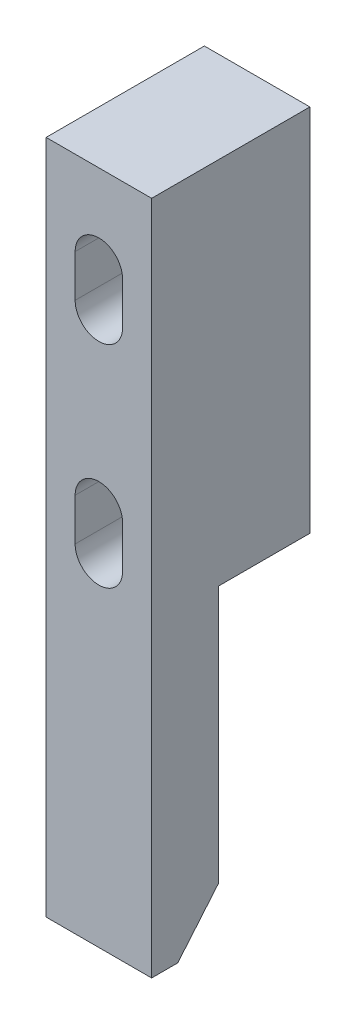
ISO-10303-21;
HEADER;
FILE_DESCRIPTION(('STEP AP214'),'2;1');
FILE_NAME('part.step','',(''),(''),'','','');
FILE_SCHEMA(('AUTOMOTIVE_DESIGN { 1 0 10303 214 1 1 1 1 }'));
ENDSEC;
DATA;
#1=APPLICATION_CONTEXT('core data for automotive mechanical design processes');
#2=APPLICATION_PROTOCOL_DEFINITION('international standard','automotive_design',2000,#1);
#3=PRODUCT_CONTEXT('',#1,'mechanical');
#4=PRODUCT('Part','Part','',(#3));
#5=PRODUCT_RELATED_PRODUCT_CATEGORY('part','',(#4));
#6=PRODUCT_DEFINITION_FORMATION('','',#4);
#7=PRODUCT_DEFINITION_CONTEXT('part definition',#1,'design');
#8=PRODUCT_DEFINITION('design','',#6,#7);
#9=PRODUCT_DEFINITION_SHAPE('','',#8);
#10=(LENGTH_UNIT() NAMED_UNIT(*) SI_UNIT(.MILLI.,.METRE.));
#11=(NAMED_UNIT(*) PLANE_ANGLE_UNIT() SI_UNIT($,.RADIAN.));
#12=(NAMED_UNIT(*) SI_UNIT($,.STERADIAN.) SOLID_ANGLE_UNIT());
#13=UNCERTAINTY_MEASURE_WITH_UNIT(LENGTH_MEASURE(1.E-05),#10,'distance_accuracy_value','');
#14=(GEOMETRIC_REPRESENTATION_CONTEXT(3) GLOBAL_UNCERTAINTY_ASSIGNED_CONTEXT((#13)) GLOBAL_UNIT_ASSIGNED_CONTEXT((#10,
#11,#12)) REPRESENTATION_CONTEXT('',''));
#15=CARTESIAN_POINT('',(0.,0.,0.));
#16=DIRECTION('',(0.,0.,1.));
#17=DIRECTION('',(1.,0.,0.));
#18=AXIS2_PLACEMENT_3D('',#15,#16,#17);
#19=CARTESIAN_POINT('',(10.,0.,0.));
#20=DIRECTION('',(0.,0.,1.));
#21=DIRECTION('',(1.,0.,0.));
#22=AXIS2_PLACEMENT_3D('',#19,#20,#21);
#23=PLANE('',#22);
#24=CARTESIAN_POINT('',(5.,52.,0.));
#25=DIRECTION('',(0.,0.,1.));
#26=DIRECTION('',(1.,0.,0.));
#27=AXIS2_PLACEMENT_3D('',#24,#25,#26);
#28=CIRCLE('',#27,2.25);
#29=CARTESIAN_POINT('',(2.75,52.,0.));
#30=VERTEX_POINT('',#29);
#31=CARTESIAN_POINT('',(7.25,52.,0.));
#32=VERTEX_POINT('',#31);
#33=EDGE_CURVE('E165',#30,#32,#28,.T.);
#34=ORIENTED_EDGE('',*,*,#33,.T.);
#35=DIRECTION('',(0.,1.,0.));
#36=VECTOR('',#35,1.);
#37=CARTESIAN_POINT('',(7.25,52.,0.));
#38=LINE('',#37,#36);
#39=CARTESIAN_POINT('',(7.25,56.,0.));
#40=VERTEX_POINT('',#39);
#41=EDGE_CURVE('E180',#32,#40,#38,.T.);
#42=ORIENTED_EDGE('',*,*,#41,.T.);
#43=CARTESIAN_POINT('',(5.,56.,0.));
#44=DIRECTION('',(0.,0.,1.));
#45=DIRECTION('',(1.,0.,0.));
#46=AXIS2_PLACEMENT_3D('',#43,#44,#45);
#47=CIRCLE('',#46,2.25);
#48=CARTESIAN_POINT('',(2.75,56.,0.));
#49=VERTEX_POINT('',#48);
#50=EDGE_CURVE('E183',#40,#49,#47,.T.);
#51=ORIENTED_EDGE('',*,*,#50,.T.);
#52=DIRECTION('',(0.,-1.,0.));
#53=VECTOR('',#52,1.);
#54=CARTESIAN_POINT('',(2.75,56.,0.));
#55=LINE('',#54,#53);
#56=EDGE_CURVE('E171',#49,#30,#55,.T.);
#57=ORIENTED_EDGE('',*,*,#56,.T.);
#58=EDGE_LOOP('',(#34,#42,#51,#57));
#59=FACE_BOUND('',#58,.T.);
#60=CARTESIAN_POINT('',(5.,32.,0.));
#61=DIRECTION('',(0.,0.,1.));
#62=DIRECTION('',(1.,0.,0.));
#63=AXIS2_PLACEMENT_3D('',#60,#61,#62);
#64=CIRCLE('',#63,2.25);
#65=CARTESIAN_POINT('',(2.75,32.,0.));
#66=VERTEX_POINT('',#65);
#67=CARTESIAN_POINT('',(7.25,32.,0.));
#68=VERTEX_POINT('',#67);
#69=EDGE_CURVE('E196',#66,#68,#64,.T.);
#70=ORIENTED_EDGE('',*,*,#69,.T.);
#71=DIRECTION('',(0.,1.,0.));
#72=VECTOR('',#71,1.);
#73=CARTESIAN_POINT('',(7.25,32.,0.));
#74=LINE('',#73,#72);
#75=CARTESIAN_POINT('',(7.25,36.,0.));
#76=VERTEX_POINT('',#75);
#77=EDGE_CURVE('E210',#68,#76,#74,.T.);
#78=ORIENTED_EDGE('',*,*,#77,.T.);
#79=CARTESIAN_POINT('',(5.,36.,0.));
#80=DIRECTION('',(0.,0.,1.));
#81=DIRECTION('',(1.,0.,0.));
#82=AXIS2_PLACEMENT_3D('',#79,#80,#81);
#83=CIRCLE('',#82,2.25);
#84=CARTESIAN_POINT('',(2.75,36.,0.));
#85=VERTEX_POINT('',#84);
#86=EDGE_CURVE('E213',#76,#85,#83,.T.);
#87=ORIENTED_EDGE('',*,*,#86,.T.);
#88=DIRECTION('',(0.,-1.,0.));
#89=VECTOR('',#88,1.);
#90=CARTESIAN_POINT('',(2.75,36.,0.));
#91=LINE('',#90,#89);
#92=EDGE_CURVE('E200',#85,#66,#91,.T.);
#93=ORIENTED_EDGE('',*,*,#92,.T.);
#94=EDGE_LOOP('',(#70,#78,#87,#93));
#95=FACE_BOUND('',#94,.T.);
#96=DIRECTION('',(1.,0.,0.));
#97=VECTOR('',#96,1.);
#98=CARTESIAN_POINT('',(-5.,29.,0.));
#99=LINE('',#98,#97);
#100=CARTESIAN_POINT('',(0.,29.,0.));
#101=VERTEX_POINT('',#100);
#102=CARTESIAN_POINT('',(10.,29.,0.));
#103=VERTEX_POINT('',#102);
#104=EDGE_CURVE('E147',#101,#103,#99,.T.);
#105=ORIENTED_EDGE('',*,*,#104,.F.);
#106=DIRECTION('',(0.,-1.,0.));
#107=VECTOR('',#106,1.);
#108=CARTESIAN_POINT('',(0.,0.,0.));
#109=LINE('',#108,#107);
#110=CARTESIAN_POINT('',(0.,64.,0.));
#111=VERTEX_POINT('',#110);
#112=EDGE_CURVE('E232',#111,#101,#109,.T.);
#113=ORIENTED_EDGE('',*,*,#112,.F.);
#114=DIRECTION('',(-1.,0.,0.));
#115=VECTOR('',#114,1.);
#116=CARTESIAN_POINT('',(0.,64.,0.));
#117=LINE('',#116,#115);
#118=CARTESIAN_POINT('',(10.,64.,0.));
#119=VERTEX_POINT('',#118);
#120=EDGE_CURVE('E240',#119,#111,#117,.T.);
#121=ORIENTED_EDGE('',*,*,#120,.F.);
#122=DIRECTION('',(0.,1.,0.));
#123=VECTOR('',#122,1.);
#124=CARTESIAN_POINT('',(10.,0.,0.));
#125=LINE('',#124,#123);
#126=EDGE_CURVE('E227',#103,#119,#125,.T.);
#127=ORIENTED_EDGE('',*,*,#126,.F.);
#128=EDGE_LOOP('',(#105,#113,#121,#127));
#129=FACE_BOUND('',#128,.T.);
#130=ADVANCED_FACE('F33',(#59,#95,#129),#23,.F.);
#131=CARTESIAN_POINT('',(0.,0.,15.));
#132=DIRECTION('',(0.,1.,0.));
#133=DIRECTION('',(0.,0.,1.));
#134=AXIS2_PLACEMENT_3D('',#131,#132,#133);
#135=PLANE('',#134);
#136=DIRECTION('',(1.,0.,0.));
#137=VECTOR('',#136,1.);
#138=CARTESIAN_POINT('',(-5.,0.,12.5236974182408));
#139=LINE('',#138,#137);
#140=CARTESIAN_POINT('',(0.,0.,12.5236974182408));
#141=VERTEX_POINT('',#140);
#142=CARTESIAN_POINT('',(10.,0.,12.5236974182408));
#143=VERTEX_POINT('',#142);
#144=EDGE_CURVE('E162',#141,#143,#139,.T.);
#145=ORIENTED_EDGE('',*,*,#144,.T.);
#146=DIRECTION('',(0.,0.,-1.));
#147=VECTOR('',#146,1.);
#148=CARTESIAN_POINT('',(10.,0.,15.));
#149=LINE('',#148,#147);
#150=CARTESIAN_POINT('',(10.,0.,15.));
#151=VERTEX_POINT('',#150);
#152=EDGE_CURVE('E252',#151,#143,#149,.T.);
#153=ORIENTED_EDGE('',*,*,#152,.F.);
#154=DIRECTION('',(1.,0.,0.));
#155=VECTOR('',#154,1.);
#156=CARTESIAN_POINT('',(0.,0.,15.));
#157=LINE('',#156,#155);
#158=CARTESIAN_POINT('',(0.,0.,15.));
#159=VERTEX_POINT('',#158);
#160=EDGE_CURVE('E228',#159,#151,#157,.T.);
#161=ORIENTED_EDGE('',*,*,#160,.F.);
#162=DIRECTION('',(0.,0.,-1.));
#163=VECTOR('',#162,1.);
#164=CARTESIAN_POINT('',(0.,0.,15.));
#165=LINE('',#164,#163);
#166=EDGE_CURVE('E238',#159,#141,#165,.T.);
#167=ORIENTED_EDGE('',*,*,#166,.T.);
#168=EDGE_LOOP('',(#145,#153,#161,#167));
#169=FACE_BOUND('',#168,.T.);
#170=ADVANCED_FACE('F35',(#169),#135,.F.);
#171=CARTESIAN_POINT('',(10.,0.,15.));
#172=DIRECTION('',(-1.,0.,0.));
#173=DIRECTION('',(0.,0.,1.));
#174=AXIS2_PLACEMENT_3D('',#171,#172,#173);
#175=PLANE('',#174);
#176=DIRECTION('',(0.,0.766044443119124,-0.642787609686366));
#177=VECTOR('',#176,1.);
#178=CARTESIAN_POINT('',(10.,0.,12.5236974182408));
#179=LINE('',#178,#177);
#180=CARTESIAN_POINT('',(10.,4.61649281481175,8.65000000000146));
#181=VERTEX_POINT('',#180);
#182=EDGE_CURVE('E158',#143,#181,#179,.T.);
#183=ORIENTED_EDGE('',*,*,#182,.T.);
#184=DIRECTION('',(0.,1.,0.));
#185=VECTOR('',#184,1.);
#186=CARTESIAN_POINT('',(10.,4.61649281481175,8.65000000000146));
#187=LINE('',#186,#185);
#188=CARTESIAN_POINT('',(10.,29.,8.65000000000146));
#189=VERTEX_POINT('',#188);
#190=EDGE_CURVE('E141',#181,#189,#187,.T.);
#191=ORIENTED_EDGE('',*,*,#190,.T.);
#192=DIRECTION('',(0.,0.,-1.));
#193=VECTOR('',#192,1.);
#194=CARTESIAN_POINT('',(10.,29.,8.65000000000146));
#195=LINE('',#194,#193);
#196=EDGE_CURVE('E150',#189,#103,#195,.T.);
#197=ORIENTED_EDGE('',*,*,#196,.T.);
#198=ORIENTED_EDGE('',*,*,#126,.T.);
#199=DIRECTION('',(0.,0.,-1.));
#200=VECTOR('',#199,1.);
#201=CARTESIAN_POINT('',(10.,64.,15.));
#202=LINE('',#201,#200);
#203=CARTESIAN_POINT('',(10.,64.,15.));
#204=VERTEX_POINT('',#203);
#205=EDGE_CURVE('E249',#204,#119,#202,.T.);
#206=ORIENTED_EDGE('',*,*,#205,.F.);
#207=DIRECTION('',(0.,1.,0.));
#208=VECTOR('',#207,1.);
#209=CARTESIAN_POINT('',(10.,0.,15.));
#210=LINE('',#209,#208);
#211=EDGE_CURVE('E231',#151,#204,#210,.T.);
#212=ORIENTED_EDGE('',*,*,#211,.F.);
#213=ORIENTED_EDGE('',*,*,#152,.T.);
#214=EDGE_LOOP('',(#183,#191,#197,#198,#206,#212,#213));
#215=FACE_BOUND('',#214,.T.);
#216=ADVANCED_FACE('F156',(#215),#175,.F.);
#217=CARTESIAN_POINT('',(0.,0.,15.));
#218=DIRECTION('',(1.,0.,0.));
#219=DIRECTION('',(0.,0.,-1.));
#220=AXIS2_PLACEMENT_3D('',#217,#218,#219);
#221=PLANE('',#220);
#222=DIRECTION('',(0.,0.766044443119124,-0.642787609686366));
#223=VECTOR('',#222,1.);
#224=CARTESIAN_POINT('',(0.,-1.21934099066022,13.5468459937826));
#225=LINE('',#224,#223);
#226=CARTESIAN_POINT('',(0.,4.61649281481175,8.65000000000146));
#227=VERTEX_POINT('',#226);
#228=EDGE_CURVE('E12',#141,#227,#225,.T.);
#229=ORIENTED_EDGE('',*,*,#228,.F.);
#230=ORIENTED_EDGE('',*,*,#166,.F.);
#231=DIRECTION('',(0.,-1.,0.));
#232=VECTOR('',#231,1.);
#233=CARTESIAN_POINT('',(0.,0.,15.));
#234=LINE('',#233,#232);
#235=CARTESIAN_POINT('',(0.,64.,15.));
#236=VERTEX_POINT('',#235);
#237=EDGE_CURVE('E236',#236,#159,#234,.T.);
#238=ORIENTED_EDGE('',*,*,#237,.F.);
#239=DIRECTION('',(0.,0.,-1.));
#240=VECTOR('',#239,1.);
#241=CARTESIAN_POINT('',(0.,64.,15.));
#242=LINE('',#241,#240);
#243=EDGE_CURVE('E246',#236,#111,#242,.T.);
#244=ORIENTED_EDGE('',*,*,#243,.T.);
#245=ORIENTED_EDGE('',*,*,#112,.T.);
#246=DIRECTION('',(0.,0.,-1.));
#247=VECTOR('',#246,1.);
#248=CARTESIAN_POINT('',(0.,29.,15.));
#249=LINE('',#248,#247);
#250=CARTESIAN_POINT('',(0.,29.,8.65000000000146));
#251=VERTEX_POINT('',#250);
#252=EDGE_CURVE('E41',#251,#101,#249,.T.);
#253=ORIENTED_EDGE('',*,*,#252,.F.);
#254=DIRECTION('',(0.,1.,0.));
#255=VECTOR('',#254,1.);
#256=CARTESIAN_POINT('',(0.,0.,8.65000000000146));
#257=LINE('',#256,#255);
#258=EDGE_CURVE('E144',#227,#251,#257,.T.);
#259=ORIENTED_EDGE('',*,*,#258,.F.);
#260=EDGE_LOOP('',(#229,#230,#238,#244,#245,#253,#259));
#261=FACE_BOUND('',#260,.T.);
#262=ADVANCED_FACE('F259',(#261),#221,.F.);
#263=CARTESIAN_POINT('',(10.,0.,15.));
#264=DIRECTION('',(0.,0.,1.));
#265=DIRECTION('',(1.,0.,0.));
#266=AXIS2_PLACEMENT_3D('',#263,#264,#265);
#267=PLANE('',#266);
#268=DIRECTION('',(0.,1.,0.));
#269=VECTOR('',#268,1.);
#270=CARTESIAN_POINT('',(7.25,32.,15.));
#271=LINE('',#270,#269);
#272=CARTESIAN_POINT('',(7.25,32.,15.));
#273=VERTEX_POINT('',#272);
#274=CARTESIAN_POINT('',(7.25,36.,15.));
#275=VERTEX_POINT('',#274);
#276=EDGE_CURVE('E199',#273,#275,#271,.T.);
#277=ORIENTED_EDGE('',*,*,#276,.F.);
#278=CARTESIAN_POINT('',(5.,32.,15.));
#279=DIRECTION('',(0.,0.,1.));
#280=DIRECTION('',(1.,0.,0.));
#281=AXIS2_PLACEMENT_3D('',#278,#279,#280);
#282=CIRCLE('',#281,2.25);
#283=CARTESIAN_POINT('',(2.75,32.,15.));
#284=VERTEX_POINT('',#283);
#285=EDGE_CURVE('E197',#284,#273,#282,.T.);
#286=ORIENTED_EDGE('',*,*,#285,.F.);
#287=DIRECTION('',(0.,-1.,0.));
#288=VECTOR('',#287,1.);
#289=CARTESIAN_POINT('',(2.75,36.,15.));
#290=LINE('',#289,#288);
#291=CARTESIAN_POINT('',(2.75,36.,15.));
#292=VERTEX_POINT('',#291);
#293=EDGE_CURVE('E205',#292,#284,#290,.T.);
#294=ORIENTED_EDGE('',*,*,#293,.F.);
#295=CARTESIAN_POINT('',(5.,36.,15.));
#296=DIRECTION('',(0.,0.,1.));
#297=DIRECTION('',(1.,0.,0.));
#298=AXIS2_PLACEMENT_3D('',#295,#296,#297);
#299=CIRCLE('',#298,2.25);
#300=EDGE_CURVE('E202',#275,#292,#299,.T.);
#301=ORIENTED_EDGE('',*,*,#300,.F.);
#302=EDGE_LOOP('',(#277,#286,#294,#301));
#303=FACE_BOUND('',#302,.T.);
#304=ORIENTED_EDGE('',*,*,#160,.T.);
#305=ORIENTED_EDGE('',*,*,#211,.T.);
#306=DIRECTION('',(-1.,0.,0.));
#307=VECTOR('',#306,1.);
#308=CARTESIAN_POINT('',(0.,64.,15.));
#309=LINE('',#308,#307);
#310=EDGE_CURVE('E234',#204,#236,#309,.T.);
#311=ORIENTED_EDGE('',*,*,#310,.T.);
#312=ORIENTED_EDGE('',*,*,#237,.T.);
#313=EDGE_LOOP('',(#304,#305,#311,#312));
#314=FACE_BOUND('',#313,.T.);
#315=DIRECTION('',(0.,1.,0.));
#316=VECTOR('',#315,1.);
#317=CARTESIAN_POINT('',(7.25,52.,15.));
#318=LINE('',#317,#316);
#319=CARTESIAN_POINT('',(7.25,52.,15.));
#320=VERTEX_POINT('',#319);
#321=CARTESIAN_POINT('',(7.25,56.,15.));
#322=VERTEX_POINT('',#321);
#323=EDGE_CURVE('E170',#320,#322,#318,.T.);
#324=ORIENTED_EDGE('',*,*,#323,.F.);
#325=CARTESIAN_POINT('',(5.,52.,15.));
#326=DIRECTION('',(0.,0.,1.));
#327=DIRECTION('',(1.,0.,0.));
#328=AXIS2_PLACEMENT_3D('',#325,#326,#327);
#329=CIRCLE('',#328,2.25);
#330=CARTESIAN_POINT('',(2.75,52.,15.));
#331=VERTEX_POINT('',#330);
#332=EDGE_CURVE('E168',#331,#320,#329,.T.);
#333=ORIENTED_EDGE('',*,*,#332,.F.);
#334=DIRECTION('',(0.,-1.,0.));
#335=VECTOR('',#334,1.);
#336=CARTESIAN_POINT('',(2.75,56.,15.));
#337=LINE('',#336,#335);
#338=CARTESIAN_POINT('',(2.75,56.,15.));
#339=VERTEX_POINT('',#338);
#340=EDGE_CURVE('E175',#339,#331,#337,.T.);
#341=ORIENTED_EDGE('',*,*,#340,.F.);
#342=CARTESIAN_POINT('',(5.,56.,15.));
#343=DIRECTION('',(0.,0.,1.));
#344=DIRECTION('',(1.,0.,0.));
#345=AXIS2_PLACEMENT_3D('',#342,#343,#344);
#346=CIRCLE('',#345,2.25);
#347=EDGE_CURVE('E173',#322,#339,#346,.T.);
#348=ORIENTED_EDGE('',*,*,#347,.F.);
#349=EDGE_LOOP('',(#324,#333,#341,#348));
#350=FACE_BOUND('',#349,.T.);
#351=ADVANCED_FACE('F270',(#303,#314,#350),#267,.T.);
#352=CARTESIAN_POINT('',(0.,64.,15.));
#353=DIRECTION('',(0.,-1.,0.));
#354=DIRECTION('',(0.,0.,-1.));
#355=AXIS2_PLACEMENT_3D('',#352,#353,#354);
#356=PLANE('',#355);
#357=ORIENTED_EDGE('',*,*,#120,.T.);
#358=ORIENTED_EDGE('',*,*,#243,.F.);
#359=ORIENTED_EDGE('',*,*,#310,.F.);
#360=ORIENTED_EDGE('',*,*,#205,.T.);
#361=EDGE_LOOP('',(#357,#358,#359,#360));
#362=FACE_BOUND('',#361,.T.);
#363=ADVANCED_FACE('F265',(#362),#356,.F.);
#364=CARTESIAN_POINT('',(5.,32.,15.));
#365=DIRECTION('',(0.,0.,-1.));
#366=DIRECTION('',(-1.,0.,0.));
#367=AXIS2_PLACEMENT_3D('',#364,#365,#366);
#368=CYLINDRICAL_SURFACE('',#367,2.25);
#369=ORIENTED_EDGE('',*,*,#69,.F.);
#370=DIRECTION('',(0.,0.,-1.));
#371=VECTOR('',#370,1.);
#372=CARTESIAN_POINT('',(2.75,32.,15.));
#373=LINE('',#372,#371);
#374=EDGE_CURVE('E207',#284,#66,#373,.T.);
#375=ORIENTED_EDGE('',*,*,#374,.F.);
#376=ORIENTED_EDGE('',*,*,#285,.T.);
#377=DIRECTION('',(0.,0.,-1.));
#378=VECTOR('',#377,1.);
#379=CARTESIAN_POINT('',(7.25,32.,15.));
#380=LINE('',#379,#378);
#381=EDGE_CURVE('E224',#273,#68,#380,.T.);
#382=ORIENTED_EDGE('',*,*,#381,.T.);
#383=EDGE_LOOP('',(#369,#375,#376,#382));
#384=FACE_BOUND('',#383,.T.);
#385=ADVANCED_FACE('F299',(#384),#368,.F.);
#386=CARTESIAN_POINT('',(7.25,32.,15.));
#387=DIRECTION('',(-1.,0.,0.));
#388=DIRECTION('',(0.,0.,1.));
#389=AXIS2_PLACEMENT_3D('',#386,#387,#388);
#390=PLANE('',#389);
#391=ORIENTED_EDGE('',*,*,#77,.F.);
#392=ORIENTED_EDGE('',*,*,#381,.F.);
#393=ORIENTED_EDGE('',*,*,#276,.T.);
#394=DIRECTION('',(0.,0.,-1.));
#395=VECTOR('',#394,1.);
#396=CARTESIAN_POINT('',(7.25,36.,15.));
#397=LINE('',#396,#395);
#398=EDGE_CURVE('E222',#275,#76,#397,.T.);
#399=ORIENTED_EDGE('',*,*,#398,.T.);
#400=EDGE_LOOP('',(#391,#392,#393,#399));
#401=FACE_BOUND('',#400,.T.);
#402=ADVANCED_FACE('F325',(#401),#390,.T.);
#403=CARTESIAN_POINT('',(5.,36.,15.));
#404=DIRECTION('',(0.,0.,-1.));
#405=DIRECTION('',(-1.,0.,0.));
#406=AXIS2_PLACEMENT_3D('',#403,#404,#405);
#407=CYLINDRICAL_SURFACE('',#406,2.25);
#408=ORIENTED_EDGE('',*,*,#86,.F.);
#409=ORIENTED_EDGE('',*,*,#398,.F.);
#410=ORIENTED_EDGE('',*,*,#300,.T.);
#411=DIRECTION('',(0.,0.,-1.));
#412=VECTOR('',#411,1.);
#413=CARTESIAN_POINT('',(2.75,36.,15.));
#414=LINE('',#413,#412);
#415=EDGE_CURVE('E220',#292,#85,#414,.T.);
#416=ORIENTED_EDGE('',*,*,#415,.T.);
#417=EDGE_LOOP('',(#408,#409,#410,#416));
#418=FACE_BOUND('',#417,.T.);
#419=ADVANCED_FACE('F332',(#418),#407,.F.);
#420=CARTESIAN_POINT('',(2.75,36.,15.));
#421=DIRECTION('',(1.,0.,0.));
#422=DIRECTION('',(0.,0.,-1.));
#423=AXIS2_PLACEMENT_3D('',#420,#421,#422);
#424=PLANE('',#423);
#425=ORIENTED_EDGE('',*,*,#92,.F.);
#426=ORIENTED_EDGE('',*,*,#415,.F.);
#427=ORIENTED_EDGE('',*,*,#293,.T.);
#428=ORIENTED_EDGE('',*,*,#374,.T.);
#429=EDGE_LOOP('',(#425,#426,#427,#428));
#430=FACE_BOUND('',#429,.T.);
#431=ADVANCED_FACE('F340',(#430),#424,.T.);
#432=CARTESIAN_POINT('',(5.,52.,15.));
#433=DIRECTION('',(0.,0.,-1.));
#434=DIRECTION('',(-1.,0.,0.));
#435=AXIS2_PLACEMENT_3D('',#432,#433,#434);
#436=CYLINDRICAL_SURFACE('',#435,2.25);
#437=ORIENTED_EDGE('',*,*,#33,.F.);
#438=DIRECTION('',(0.,0.,-1.));
#439=VECTOR('',#438,1.);
#440=CARTESIAN_POINT('',(2.75,52.,15.));
#441=LINE('',#440,#439);
#442=EDGE_CURVE('E177',#331,#30,#441,.T.);
#443=ORIENTED_EDGE('',*,*,#442,.F.);
#444=ORIENTED_EDGE('',*,*,#332,.T.);
#445=DIRECTION('',(0.,0.,-1.));
#446=VECTOR('',#445,1.);
#447=CARTESIAN_POINT('',(7.25,52.,15.));
#448=LINE('',#447,#446);
#449=EDGE_CURVE('E193',#320,#32,#448,.T.);
#450=ORIENTED_EDGE('',*,*,#449,.T.);
#451=EDGE_LOOP('',(#437,#443,#444,#450));
#452=FACE_BOUND('',#451,.T.);
#453=ADVANCED_FACE('F348',(#452),#436,.F.);
#454=CARTESIAN_POINT('',(7.25,52.,15.));
#455=DIRECTION('',(-1.,0.,0.));
#456=DIRECTION('',(0.,0.,1.));
#457=AXIS2_PLACEMENT_3D('',#454,#455,#456);
#458=PLANE('',#457);
#459=ORIENTED_EDGE('',*,*,#41,.F.);
#460=ORIENTED_EDGE('',*,*,#449,.F.);
#461=ORIENTED_EDGE('',*,*,#323,.T.);
#462=DIRECTION('',(0.,0.,-1.));
#463=VECTOR('',#462,1.);
#464=CARTESIAN_POINT('',(7.25,56.,15.));
#465=LINE('',#464,#463);
#466=EDGE_CURVE('E191',#322,#40,#465,.T.);
#467=ORIENTED_EDGE('',*,*,#466,.T.);
#468=EDGE_LOOP('',(#459,#460,#461,#467));
#469=FACE_BOUND('',#468,.T.);
#470=ADVANCED_FACE('F356',(#469),#458,.T.);
#471=CARTESIAN_POINT('',(5.,56.,15.));
#472=DIRECTION('',(0.,0.,-1.));
#473=DIRECTION('',(-1.,0.,0.));
#474=AXIS2_PLACEMENT_3D('',#471,#472,#473);
#475=CYLINDRICAL_SURFACE('',#474,2.25);
#476=ORIENTED_EDGE('',*,*,#50,.F.);
#477=ORIENTED_EDGE('',*,*,#466,.F.);
#478=ORIENTED_EDGE('',*,*,#347,.T.);
#479=DIRECTION('',(0.,0.,-1.));
#480=VECTOR('',#479,1.);
#481=CARTESIAN_POINT('',(2.75,56.,15.));
#482=LINE('',#481,#480);
#483=EDGE_CURVE('E55',#339,#49,#482,.T.);
#484=ORIENTED_EDGE('',*,*,#483,.T.);
#485=EDGE_LOOP('',(#476,#477,#478,#484));
#486=FACE_BOUND('',#485,.T.);
#487=ADVANCED_FACE('F283',(#486),#475,.F.);
#488=CARTESIAN_POINT('',(2.75,56.,15.));
#489=DIRECTION('',(1.,0.,0.));
#490=DIRECTION('',(0.,0.,-1.));
#491=AXIS2_PLACEMENT_3D('',#488,#489,#490);
#492=PLANE('',#491);
#493=ORIENTED_EDGE('',*,*,#56,.F.);
#494=ORIENTED_EDGE('',*,*,#483,.F.);
#495=ORIENTED_EDGE('',*,*,#340,.T.);
#496=ORIENTED_EDGE('',*,*,#442,.T.);
#497=EDGE_LOOP('',(#493,#494,#495,#496));
#498=FACE_BOUND('',#497,.T.);
#499=ADVANCED_FACE('F276',(#498),#492,.T.);
#500=CARTESIAN_POINT('',(-5.,0.,12.5236974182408));
#501=DIRECTION('',(0.,-0.642787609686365,-0.766044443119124));
#502=DIRECTION('',(0.,0.766044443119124,-0.642787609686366));
#503=AXIS2_PLACEMENT_3D('',#500,#501,#502);
#504=PLANE('',#503);
#505=ORIENTED_EDGE('',*,*,#228,.T.);
#506=DIRECTION('',(1.,0.,0.));
#507=VECTOR('',#506,1.);
#508=CARTESIAN_POINT('',(-5.,4.61649281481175,8.65000000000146));
#509=LINE('',#508,#507);
#510=EDGE_CURVE('E48',#227,#181,#509,.T.);
#511=ORIENTED_EDGE('',*,*,#510,.T.);
#512=ORIENTED_EDGE('',*,*,#182,.F.);
#513=ORIENTED_EDGE('',*,*,#144,.F.);
#514=EDGE_LOOP('',(#505,#511,#512,#513));
#515=FACE_BOUND('',#514,.T.);
#516=ADVANCED_FACE('F274',(#515),#504,.T.);
#517=CARTESIAN_POINT('',(-5.,29.,8.65000000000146));
#518=DIRECTION('',(0.,-1.,0.));
#519=DIRECTION('',(0.,0.,-1.));
#520=AXIS2_PLACEMENT_3D('',#517,#518,#519);
#521=PLANE('',#520);
#522=ORIENTED_EDGE('',*,*,#252,.T.);
#523=ORIENTED_EDGE('',*,*,#104,.T.);
#524=ORIENTED_EDGE('',*,*,#196,.F.);
#525=DIRECTION('',(1.,0.,0.));
#526=VECTOR('',#525,1.);
#527=CARTESIAN_POINT('',(-5.,29.,8.65000000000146));
#528=LINE('',#527,#526);
#529=EDGE_CURVE('E137',#251,#189,#528,.T.);
#530=ORIENTED_EDGE('',*,*,#529,.F.);
#531=EDGE_LOOP('',(#522,#523,#524,#530));
#532=FACE_BOUND('',#531,.T.);
#533=ADVANCED_FACE('F151',(#532),#521,.T.);
#534=CARTESIAN_POINT('',(-5.,4.61649281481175,8.65000000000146));
#535=DIRECTION('',(0.,0.,-1.));
#536=DIRECTION('',(-1.,0.,0.));
#537=AXIS2_PLACEMENT_3D('',#534,#535,#536);
#538=PLANE('',#537);
#539=ORIENTED_EDGE('',*,*,#258,.T.);
#540=ORIENTED_EDGE('',*,*,#529,.T.);
#541=ORIENTED_EDGE('',*,*,#190,.F.);
#542=ORIENTED_EDGE('',*,*,#510,.F.);
#543=EDGE_LOOP('',(#539,#540,#541,#542));
#544=FACE_BOUND('',#543,.T.);
#545=ADVANCED_FACE('F139',(#544),#538,.T.);
#546=CLOSED_SHELL('',(#130,#170,#216,#262,#351,#363,#385,#402,#419,#431,#453,#470,#487,#499,
#516,#533,#545));
#547=MANIFOLD_SOLID_BREP('B2',#546);
#548=ADVANCED_BREP_SHAPE_REPRESENTATION('',(#18,#547),#14);
#549=SHAPE_DEFINITION_REPRESENTATION(#9,#548);
ENDSEC;
END-ISO-10303-21;
